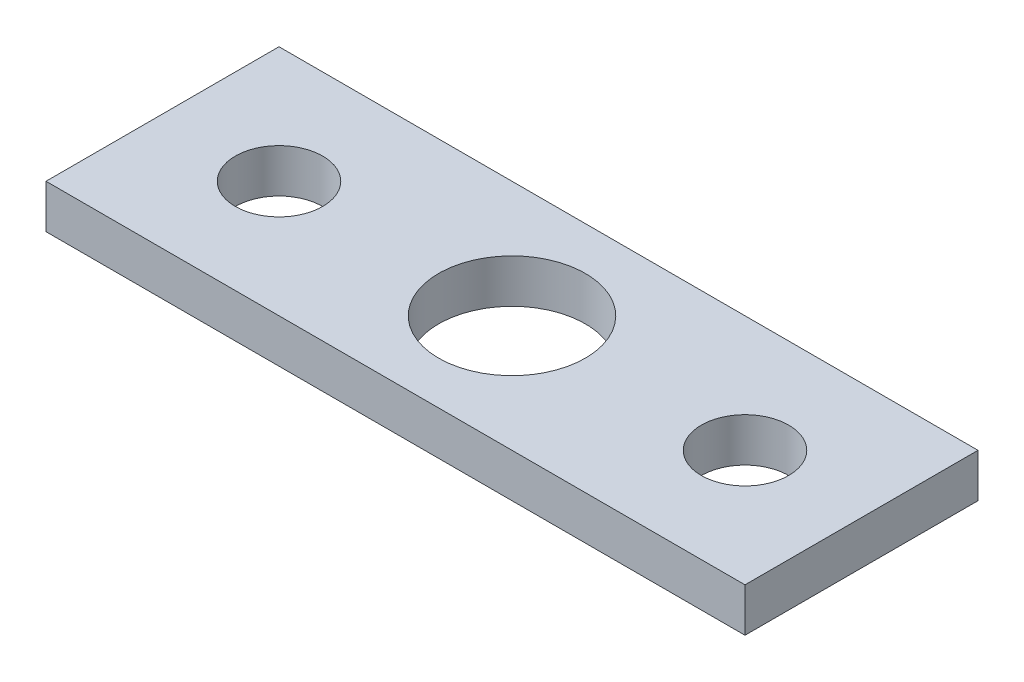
ISO-10303-21;
HEADER;
FILE_DESCRIPTION(('STEP AP214'),'2;1');
FILE_NAME('part.step','',(''),(''),'','','');
FILE_SCHEMA(('AUTOMOTIVE_DESIGN { 1 0 10303 214 1 1 1 1 }'));
ENDSEC;
DATA;
#1=APPLICATION_CONTEXT('core data for automotive mechanical design processes');
#2=APPLICATION_PROTOCOL_DEFINITION('international standard','automotive_design',2000,#1);
#3=PRODUCT_CONTEXT('',#1,'mechanical');
#4=PRODUCT('Part','Part','',(#3));
#5=PRODUCT_RELATED_PRODUCT_CATEGORY('part','',(#4));
#6=PRODUCT_DEFINITION_FORMATION('','',#4);
#7=PRODUCT_DEFINITION_CONTEXT('part definition',#1,'design');
#8=PRODUCT_DEFINITION('design','',#6,#7);
#9=PRODUCT_DEFINITION_SHAPE('','',#8);
#10=(LENGTH_UNIT() NAMED_UNIT(*) SI_UNIT(.MILLI.,.METRE.));
#11=(NAMED_UNIT(*) PLANE_ANGLE_UNIT() SI_UNIT($,.RADIAN.));
#12=(NAMED_UNIT(*) SI_UNIT($,.STERADIAN.) SOLID_ANGLE_UNIT());
#13=UNCERTAINTY_MEASURE_WITH_UNIT(LENGTH_MEASURE(1.E-05),#10,'distance_accuracy_value','');
#14=(GEOMETRIC_REPRESENTATION_CONTEXT(3) GLOBAL_UNCERTAINTY_ASSIGNED_CONTEXT((#13)) GLOBAL_UNIT_ASSIGNED_CONTEXT((#10,
#11,#12)) REPRESENTATION_CONTEXT('',''));
#15=CARTESIAN_POINT('',(0.,0.,0.));
#16=DIRECTION('',(0.,0.,1.));
#17=DIRECTION('',(1.,0.,0.));
#18=AXIS2_PLACEMENT_3D('',#15,#16,#17);
#19=CARTESIAN_POINT('',(-76.2,9.525,-25.4));
#20=DIRECTION('',(1.,0.,0.));
#21=DIRECTION('',(0.,0.,-1.));
#22=AXIS2_PLACEMENT_3D('',#19,#20,#21);
#23=PLANE('',#22);
#24=DIRECTION('',(0.,0.,1.));
#25=VECTOR('',#24,1.);
#26=CARTESIAN_POINT('',(-76.2,0.,-25.4));
#27=LINE('',#26,#25);
#28=CARTESIAN_POINT('',(-76.2,0.,-25.4));
#29=VERTEX_POINT('',#28);
#30=CARTESIAN_POINT('',(-76.2,0.,25.4));
#31=VERTEX_POINT('',#30);
#32=EDGE_CURVE('E74',#29,#31,#27,.T.);
#33=ORIENTED_EDGE('',*,*,#32,.T.);
#34=DIRECTION('',(0.,-1.,0.));
#35=VECTOR('',#34,1.);
#36=CARTESIAN_POINT('',(-76.2,9.525,25.4));
#37=LINE('',#36,#35);
#38=CARTESIAN_POINT('',(-76.2,9.525,25.4));
#39=VERTEX_POINT('',#38);
#40=EDGE_CURVE('E11',#39,#31,#37,.T.);
#41=ORIENTED_EDGE('',*,*,#40,.F.);
#42=DIRECTION('',(0.,0.,1.));
#43=VECTOR('',#42,1.);
#44=CARTESIAN_POINT('',(-76.2,9.525,-25.4));
#45=LINE('',#44,#43);
#46=CARTESIAN_POINT('',(-76.2,9.525,-25.4));
#47=VERTEX_POINT('',#46);
#48=EDGE_CURVE('E97',#47,#39,#45,.T.);
#49=ORIENTED_EDGE('',*,*,#48,.F.);
#50=DIRECTION('',(0.,-1.,0.));
#51=VECTOR('',#50,1.);
#52=CARTESIAN_POINT('',(-76.2,9.525,-25.4));
#53=LINE('',#52,#51);
#54=EDGE_CURVE('E86',#47,#29,#53,.T.);
#55=ORIENTED_EDGE('',*,*,#54,.T.);
#56=EDGE_LOOP('',(#33,#41,#49,#55));
#57=FACE_BOUND('',#56,.T.);
#58=ADVANCED_FACE('F30',(#57),#23,.F.);
#59=CARTESIAN_POINT('',(-76.2,9.525,25.4));
#60=DIRECTION('',(0.,0.,-1.));
#61=DIRECTION('',(-1.,0.,0.));
#62=AXIS2_PLACEMENT_3D('',#59,#60,#61);
#63=PLANE('',#62);
#64=DIRECTION('',(1.,0.,0.));
#65=VECTOR('',#64,1.);
#66=CARTESIAN_POINT('',(-76.2,0.,25.4));
#67=LINE('',#66,#65);
#68=CARTESIAN_POINT('',(76.2,0.,25.4));
#69=VERTEX_POINT('',#68);
#70=EDGE_CURVE('E70',#31,#69,#67,.T.);
#71=ORIENTED_EDGE('',*,*,#70,.T.);
#72=DIRECTION('',(0.,-1.,0.));
#73=VECTOR('',#72,1.);
#74=CARTESIAN_POINT('',(76.2,9.525,25.4));
#75=LINE('',#74,#73);
#76=CARTESIAN_POINT('',(76.2,9.525,25.4));
#77=VERTEX_POINT('',#76);
#78=EDGE_CURVE('E37',#77,#69,#75,.T.);
#79=ORIENTED_EDGE('',*,*,#78,.F.);
#80=DIRECTION('',(1.,0.,0.));
#81=VECTOR('',#80,1.);
#82=CARTESIAN_POINT('',(-76.2,9.525,25.4));
#83=LINE('',#82,#81);
#84=EDGE_CURVE('E82',#39,#77,#83,.T.);
#85=ORIENTED_EDGE('',*,*,#84,.F.);
#86=ORIENTED_EDGE('',*,*,#40,.T.);
#87=EDGE_LOOP('',(#71,#79,#85,#86));
#88=FACE_BOUND('',#87,.T.);
#89=ADVANCED_FACE('F81',(#88),#63,.F.);
#90=CARTESIAN_POINT('',(76.2,9.525,-25.4));
#91=DIRECTION('',(-1.,0.,0.));
#92=DIRECTION('',(0.,0.,1.));
#93=AXIS2_PLACEMENT_3D('',#90,#91,#92);
#94=PLANE('',#93);
#95=DIRECTION('',(0.,0.,-1.));
#96=VECTOR('',#95,1.);
#97=CARTESIAN_POINT('',(76.2,0.,-25.4));
#98=LINE('',#97,#96);
#99=CARTESIAN_POINT('',(76.2,0.,-25.4));
#100=VERTEX_POINT('',#99);
#101=EDGE_CURVE('E75',#69,#100,#98,.T.);
#102=ORIENTED_EDGE('',*,*,#101,.T.);
#103=DIRECTION('',(0.,-1.,0.));
#104=VECTOR('',#103,1.);
#105=CARTESIAN_POINT('',(76.2,9.525,-25.4));
#106=LINE('',#105,#104);
#107=CARTESIAN_POINT('',(76.2,9.525,-25.4));
#108=VERTEX_POINT('',#107);
#109=EDGE_CURVE('E103',#108,#100,#106,.T.);
#110=ORIENTED_EDGE('',*,*,#109,.F.);
#111=DIRECTION('',(0.,0.,-1.));
#112=VECTOR('',#111,1.);
#113=CARTESIAN_POINT('',(76.2,9.525,-25.4));
#114=LINE('',#113,#112);
#115=EDGE_CURVE('E49',#77,#108,#114,.T.);
#116=ORIENTED_EDGE('',*,*,#115,.F.);
#117=ORIENTED_EDGE('',*,*,#78,.T.);
#118=EDGE_LOOP('',(#102,#110,#116,#117));
#119=FACE_BOUND('',#118,.T.);
#120=ADVANCED_FACE('F106',(#119),#94,.F.);
#121=CARTESIAN_POINT('',(-76.2,9.525,-25.4));
#122=DIRECTION('',(0.,0.,1.));
#123=DIRECTION('',(1.,0.,0.));
#124=AXIS2_PLACEMENT_3D('',#121,#122,#123);
#125=PLANE('',#124);
#126=DIRECTION('',(-1.,0.,0.));
#127=VECTOR('',#126,1.);
#128=CARTESIAN_POINT('',(-76.2,0.,-25.4));
#129=LINE('',#128,#127);
#130=EDGE_CURVE('E95',#100,#29,#129,.T.);
#131=ORIENTED_EDGE('',*,*,#130,.T.);
#132=ORIENTED_EDGE('',*,*,#54,.F.);
#133=DIRECTION('',(-1.,0.,0.));
#134=VECTOR('',#133,1.);
#135=CARTESIAN_POINT('',(-76.2,9.525,-25.4));
#136=LINE('',#135,#134);
#137=EDGE_CURVE('E44',#108,#47,#136,.T.);
#138=ORIENTED_EDGE('',*,*,#137,.F.);
#139=ORIENTED_EDGE('',*,*,#109,.T.);
#140=EDGE_LOOP('',(#131,#132,#138,#139));
#141=FACE_BOUND('',#140,.T.);
#142=ADVANCED_FACE('F108',(#141),#125,.F.);
#143=CARTESIAN_POINT('',(-76.2,9.525,25.4));
#144=DIRECTION('',(0.,1.,0.));
#145=DIRECTION('',(0.,0.,1.));
#146=AXIS2_PLACEMENT_3D('',#143,#144,#145);
#147=PLANE('',#146);
#148=CARTESIAN_POINT('',(-50.8,9.525,0.));
#149=DIRECTION('',(0.,1.,0.));
#150=DIRECTION('',(0.,0.,1.));
#151=AXIS2_PLACEMENT_3D('',#148,#149,#150);
#152=CIRCLE('',#151,9.52500000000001);
#153=CARTESIAN_POINT('',(-50.8,9.525,9.52500000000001));
#154=VERTEX_POINT('',#153);
#155=EDGE_CURVE('E185',#154,#154,#152,.T.);
#156=ORIENTED_EDGE('',*,*,#155,.F.);
#157=EDGE_LOOP('',(#156));
#158=FACE_BOUND('',#157,.T.);
#159=CARTESIAN_POINT('',(50.8,9.525,0.));
#160=DIRECTION('',(0.,1.,0.));
#161=DIRECTION('',(0.,0.,1.));
#162=AXIS2_PLACEMENT_3D('',#159,#160,#161);
#163=CIRCLE('',#162,9.525);
#164=CARTESIAN_POINT('',(50.8,9.525,9.525));
#165=VERTEX_POINT('',#164);
#166=EDGE_CURVE('E187',#165,#165,#163,.T.);
#167=ORIENTED_EDGE('',*,*,#166,.F.);
#168=EDGE_LOOP('',(#167));
#169=FACE_BOUND('',#168,.T.);
#170=CARTESIAN_POINT('',(0.,9.525,0.));
#171=DIRECTION('',(0.,1.,0.));
#172=DIRECTION('',(0.,0.,1.));
#173=AXIS2_PLACEMENT_3D('',#170,#171,#172);
#174=CIRCLE('',#173,16.002);
#175=CARTESIAN_POINT('',(0.,9.525,16.002));
#176=VERTEX_POINT('',#175);
#177=EDGE_CURVE('E90',#176,#176,#174,.T.);
#178=ORIENTED_EDGE('',*,*,#177,.F.);
#179=EDGE_LOOP('',(#178));
#180=FACE_BOUND('',#179,.T.);
#181=ORIENTED_EDGE('',*,*,#48,.T.);
#182=ORIENTED_EDGE('',*,*,#84,.T.);
#183=ORIENTED_EDGE('',*,*,#115,.T.);
#184=ORIENTED_EDGE('',*,*,#137,.T.);
#185=EDGE_LOOP('',(#181,#182,#183,#184));
#186=FACE_BOUND('',#185,.T.);
#187=ADVANCED_FACE('F109',(#158,#169,#180,#186),#147,.T.);
#188=CARTESIAN_POINT('',(-76.2,0.,25.4));
#189=DIRECTION('',(0.,1.,0.));
#190=DIRECTION('',(0.,0.,1.));
#191=AXIS2_PLACEMENT_3D('',#188,#189,#190);
#192=PLANE('',#191);
#193=CARTESIAN_POINT('',(-50.8,0.,0.));
#194=DIRECTION('',(0.,1.,0.));
#195=DIRECTION('',(0.,0.,1.));
#196=AXIS2_PLACEMENT_3D('',#193,#194,#195);
#197=CIRCLE('',#196,9.52500000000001);
#198=CARTESIAN_POINT('',(-50.8,0.,9.52500000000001));
#199=VERTEX_POINT('',#198);
#200=EDGE_CURVE('E183',#199,#199,#197,.T.);
#201=ORIENTED_EDGE('',*,*,#200,.T.);
#202=EDGE_LOOP('',(#201));
#203=FACE_BOUND('',#202,.T.);
#204=CARTESIAN_POINT('',(50.8,0.,0.));
#205=DIRECTION('',(0.,1.,0.));
#206=DIRECTION('',(0.,0.,1.));
#207=AXIS2_PLACEMENT_3D('',#204,#205,#206);
#208=CIRCLE('',#207,9.525);
#209=CARTESIAN_POINT('',(50.8,0.,9.525));
#210=VERTEX_POINT('',#209);
#211=EDGE_CURVE('E192',#210,#210,#208,.T.);
#212=ORIENTED_EDGE('',*,*,#211,.T.);
#213=EDGE_LOOP('',(#212));
#214=FACE_BOUND('',#213,.T.);
#215=CARTESIAN_POINT('',(0.,0.,0.));
#216=DIRECTION('',(0.,1.,0.));
#217=DIRECTION('',(0.,0.,1.));
#218=AXIS2_PLACEMENT_3D('',#215,#216,#217);
#219=CIRCLE('',#218,16.002);
#220=CARTESIAN_POINT('',(0.,0.,16.002));
#221=VERTEX_POINT('',#220);
#222=EDGE_CURVE('E87',#221,#221,#219,.T.);
#223=ORIENTED_EDGE('',*,*,#222,.T.);
#224=EDGE_LOOP('',(#223));
#225=FACE_BOUND('',#224,.T.);
#226=ORIENTED_EDGE('',*,*,#32,.F.);
#227=ORIENTED_EDGE('',*,*,#130,.F.);
#228=ORIENTED_EDGE('',*,*,#101,.F.);
#229=ORIENTED_EDGE('',*,*,#70,.F.);
#230=EDGE_LOOP('',(#226,#227,#228,#229));
#231=FACE_BOUND('',#230,.T.);
#232=ADVANCED_FACE('F71',(#203,#214,#225,#231),#192,.F.);
#233=CARTESIAN_POINT('',(0.,0.,0.));
#234=DIRECTION('',(0.,1.,0.));
#235=DIRECTION('',(0.,0.,1.));
#236=AXIS2_PLACEMENT_3D('',#233,#234,#235);
#237=CYLINDRICAL_SURFACE('',#236,16.002);
#238=CARTESIAN_POINT('',(0.,0.,16.002));
#239=CARTESIAN_POINT('',(0.,0.0992187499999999,16.002));
#240=CARTESIAN_POINT('',(0.,0.1984375,16.002));
#241=CARTESIAN_POINT('',(0.,0.396875,16.002));
#242=CARTESIAN_POINT('',(0.,0.49609375,16.002));
#243=CARTESIAN_POINT('',(0.,0.69453125,16.002));
#244=CARTESIAN_POINT('',(0.,0.79375,16.002));
#245=CARTESIAN_POINT('',(0.,0.9921875,16.002));
#246=CARTESIAN_POINT('',(0.,1.09140625,16.002));
#247=CARTESIAN_POINT('',(0.,1.28984375,16.002));
#248=CARTESIAN_POINT('',(0.,1.3890625,16.002));
#249=CARTESIAN_POINT('',(0.,1.5875,16.002));
#250=CARTESIAN_POINT('',(0.,1.68671875,16.002));
#251=CARTESIAN_POINT('',(0.,1.88515625,16.002));
#252=CARTESIAN_POINT('',(0.,1.984375,16.002));
#253=CARTESIAN_POINT('',(0.,2.1828125,16.002));
#254=CARTESIAN_POINT('',(0.,2.28203125,16.002));
#255=CARTESIAN_POINT('',(0.,2.48046875,16.002));
#256=CARTESIAN_POINT('',(0.,2.5796875,16.002));
#257=CARTESIAN_POINT('',(0.,2.778125,16.002));
#258=CARTESIAN_POINT('',(0.,2.87734375,16.002));
#259=CARTESIAN_POINT('',(0.,3.07578125,16.002));
#260=CARTESIAN_POINT('',(0.,3.175,16.002));
#261=CARTESIAN_POINT('',(0.,3.3734375,16.002));
#262=CARTESIAN_POINT('',(0.,3.47265625,16.002));
#263=CARTESIAN_POINT('',(0.,3.67109375,16.002));
#264=CARTESIAN_POINT('',(0.,3.7703125,16.002));
#265=CARTESIAN_POINT('',(0.,3.96875,16.002));
#266=CARTESIAN_POINT('',(0.,4.06796875,16.002));
#267=CARTESIAN_POINT('',(0.,4.26640625,16.002));
#268=CARTESIAN_POINT('',(0.,4.365625,16.002));
#269=CARTESIAN_POINT('',(0.,4.5640625,16.002));
#270=CARTESIAN_POINT('',(0.,4.66328125,16.002));
#271=CARTESIAN_POINT('',(0.,4.86171875,16.002));
#272=CARTESIAN_POINT('',(0.,4.9609375,16.002));
#273=CARTESIAN_POINT('',(0.,5.159375,16.002));
#274=CARTESIAN_POINT('',(0.,5.25859375,16.002));
#275=CARTESIAN_POINT('',(0.,5.45703125,16.002));
#276=CARTESIAN_POINT('',(0.,5.55625,16.002));
#277=CARTESIAN_POINT('',(0.,5.7546875,16.002));
#278=CARTESIAN_POINT('',(0.,5.85390625,16.002));
#279=CARTESIAN_POINT('',(0.,6.05234375,16.002));
#280=CARTESIAN_POINT('',(0.,6.1515625,16.002));
#281=CARTESIAN_POINT('',(0.,6.35,16.002));
#282=CARTESIAN_POINT('',(0.,6.44921875,16.002));
#283=CARTESIAN_POINT('',(0.,6.64765625,16.002));
#284=CARTESIAN_POINT('',(0.,6.746875,16.002));
#285=CARTESIAN_POINT('',(0.,6.9453125,16.002));
#286=CARTESIAN_POINT('',(0.,7.04453125,16.002));
#287=CARTESIAN_POINT('',(0.,7.24296875,16.002));
#288=CARTESIAN_POINT('',(0.,7.3421875,16.002));
#289=CARTESIAN_POINT('',(0.,7.540625,16.002));
#290=CARTESIAN_POINT('',(0.,7.63984375,16.002));
#291=CARTESIAN_POINT('',(0.,7.83828125,16.002));
#292=CARTESIAN_POINT('',(0.,7.9375,16.002));
#293=CARTESIAN_POINT('',(0.,8.1359375,16.002));
#294=CARTESIAN_POINT('',(0.,8.23515625,16.002));
#295=CARTESIAN_POINT('',(0.,8.43359375,16.002));
#296=CARTESIAN_POINT('',(0.,8.5328125,16.002));
#297=CARTESIAN_POINT('',(0.,8.73125,16.002));
#298=CARTESIAN_POINT('',(0.,8.83046875,16.002));
#299=CARTESIAN_POINT('',(0.,9.02890625,16.002));
#300=CARTESIAN_POINT('',(0.,9.128125,16.002));
#301=CARTESIAN_POINT('',(0.,9.3265625,16.002));
#302=CARTESIAN_POINT('',(0.,9.42578125,16.002));
#303=CARTESIAN_POINT('',(0.,9.525,16.002));
#304=B_SPLINE_CURVE_WITH_KNOTS('',3,(#238,#239,#240,#241,#242,#243,#244,#245,#246,#247,#248,
#249,#250,#251,#252,#253,#254,#255,#256,#257,#258,#259,#260,#261,#262,#263,#264,#265,#266,#267,
#268,#269,#270,#271,#272,#273,#274,#275,#276,#277,#278,#279,#280,#281,#282,#283,#284,#285,#286,
#287,#288,#289,#290,#291,#292,#293,#294,#295,#296,#297,#298,#299,#300,#301,#302,#303),
.UNSPECIFIED.,.F.,.F.,(4,2,2,2,2,2,2,2,2,2,2,2,2,2,2,2,2,2,2,2,2,2,2,2,2,2,2,2,2,2,2,2,4),(0.,
0.29765625,0.5953125,0.89296875,1.190625,1.48828125,1.7859375,2.08359375,2.38125,2.67890625,
2.9765625,3.27421875,3.571875,3.86953125,4.1671875,4.46484375,4.7625,5.06015625,5.3578125,
5.65546875,5.953125,6.25078125,6.5484375,6.84609375,7.14375,7.44140625,7.7390625,8.03671875,
8.334375,8.63203125,8.9296875,9.22734375,9.525),.UNSPECIFIED.);
#305=EDGE_CURVE('BSEAM117',#221,#176,#304,.T.);
#306=ORIENTED_EDGE('',*,*,#222,.F.);
#307=ORIENTED_EDGE('',*,*,#177,.T.);
#308=ORIENTED_EDGE('',*,*,#305,.T.);
#309=ORIENTED_EDGE('',*,*,#305,.F.);
#310=EDGE_LOOP('',(#306,#308,#307,#309));
#311=FACE_BOUND('',#310,.T.);
#312=ADVANCED_FACE('F117',(#311),#237,.F.);
#313=CARTESIAN_POINT('',(50.8,0.,0.));
#314=DIRECTION('',(0.,1.,0.));
#315=DIRECTION('',(0.,0.,1.));
#316=AXIS2_PLACEMENT_3D('',#313,#314,#315);
#317=CYLINDRICAL_SURFACE('',#316,9.525);
#318=CARTESIAN_POINT('',(50.8,0.,9.525));
#319=CARTESIAN_POINT('',(50.8,0.0992187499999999,9.525));
#320=CARTESIAN_POINT('',(50.8,0.1984375,9.525));
#321=CARTESIAN_POINT('',(50.8,0.396875,9.525));
#322=CARTESIAN_POINT('',(50.8,0.49609375,9.525));
#323=CARTESIAN_POINT('',(50.8,0.69453125,9.525));
#324=CARTESIAN_POINT('',(50.8,0.79375,9.525));
#325=CARTESIAN_POINT('',(50.8,0.9921875,9.525));
#326=CARTESIAN_POINT('',(50.8,1.09140625,9.525));
#327=CARTESIAN_POINT('',(50.8,1.28984375,9.525));
#328=CARTESIAN_POINT('',(50.8,1.3890625,9.525));
#329=CARTESIAN_POINT('',(50.8,1.5875,9.525));
#330=CARTESIAN_POINT('',(50.8,1.68671875,9.525));
#331=CARTESIAN_POINT('',(50.8,1.88515625,9.525));
#332=CARTESIAN_POINT('',(50.8,1.984375,9.525));
#333=CARTESIAN_POINT('',(50.8,2.1828125,9.525));
#334=CARTESIAN_POINT('',(50.8,2.28203125,9.525));
#335=CARTESIAN_POINT('',(50.8,2.48046875,9.525));
#336=CARTESIAN_POINT('',(50.8,2.5796875,9.525));
#337=CARTESIAN_POINT('',(50.8,2.778125,9.525));
#338=CARTESIAN_POINT('',(50.8,2.87734375,9.525));
#339=CARTESIAN_POINT('',(50.8,3.07578125,9.525));
#340=CARTESIAN_POINT('',(50.8,3.175,9.525));
#341=CARTESIAN_POINT('',(50.8,3.3734375,9.525));
#342=CARTESIAN_POINT('',(50.8,3.47265625,9.525));
#343=CARTESIAN_POINT('',(50.8,3.67109375,9.525));
#344=CARTESIAN_POINT('',(50.8,3.7703125,9.525));
#345=CARTESIAN_POINT('',(50.8,3.96875,9.525));
#346=CARTESIAN_POINT('',(50.8,4.06796875,9.525));
#347=CARTESIAN_POINT('',(50.8,4.26640625,9.525));
#348=CARTESIAN_POINT('',(50.8,4.365625,9.525));
#349=CARTESIAN_POINT('',(50.8,4.5640625,9.525));
#350=CARTESIAN_POINT('',(50.8,4.66328125,9.525));
#351=CARTESIAN_POINT('',(50.8,4.86171875,9.525));
#352=CARTESIAN_POINT('',(50.8,4.9609375,9.525));
#353=CARTESIAN_POINT('',(50.8,5.159375,9.525));
#354=CARTESIAN_POINT('',(50.8,5.25859375,9.525));
#355=CARTESIAN_POINT('',(50.8,5.45703125,9.525));
#356=CARTESIAN_POINT('',(50.8,5.55625,9.525));
#357=CARTESIAN_POINT('',(50.8,5.7546875,9.525));
#358=CARTESIAN_POINT('',(50.8,5.85390625,9.525));
#359=CARTESIAN_POINT('',(50.8,6.05234375,9.525));
#360=CARTESIAN_POINT('',(50.8,6.1515625,9.525));
#361=CARTESIAN_POINT('',(50.8,6.35,9.525));
#362=CARTESIAN_POINT('',(50.8,6.44921875,9.525));
#363=CARTESIAN_POINT('',(50.8,6.64765625,9.525));
#364=CARTESIAN_POINT('',(50.8,6.746875,9.525));
#365=CARTESIAN_POINT('',(50.8,6.9453125,9.525));
#366=CARTESIAN_POINT('',(50.8,7.04453125,9.525));
#367=CARTESIAN_POINT('',(50.8,7.24296875,9.525));
#368=CARTESIAN_POINT('',(50.8,7.3421875,9.525));
#369=CARTESIAN_POINT('',(50.8,7.540625,9.525));
#370=CARTESIAN_POINT('',(50.8,7.63984375,9.525));
#371=CARTESIAN_POINT('',(50.8,7.83828125,9.525));
#372=CARTESIAN_POINT('',(50.8,7.9375,9.525));
#373=CARTESIAN_POINT('',(50.8,8.1359375,9.525));
#374=CARTESIAN_POINT('',(50.8,8.23515625,9.525));
#375=CARTESIAN_POINT('',(50.8,8.43359375,9.525));
#376=CARTESIAN_POINT('',(50.8,8.5328125,9.525));
#377=CARTESIAN_POINT('',(50.8,8.73125,9.525));
#378=CARTESIAN_POINT('',(50.8,8.83046875,9.525));
#379=CARTESIAN_POINT('',(50.8,9.02890625,9.525));
#380=CARTESIAN_POINT('',(50.8,9.128125,9.525));
#381=CARTESIAN_POINT('',(50.8,9.3265625,9.525));
#382=CARTESIAN_POINT('',(50.8,9.42578125,9.525));
#383=CARTESIAN_POINT('',(50.8,9.525,9.525));
#384=B_SPLINE_CURVE_WITH_KNOTS('',3,(#318,#319,#320,#321,#322,#323,#324,#325,#326,#327,#328,
#329,#330,#331,#332,#333,#334,#335,#336,#337,#338,#339,#340,#341,#342,#343,#344,#345,#346,#347,
#348,#349,#350,#351,#352,#353,#354,#355,#356,#357,#358,#359,#360,#361,#362,#363,#364,#365,#366,
#367,#368,#369,#370,#371,#372,#373,#374,#375,#376,#377,#378,#379,#380,#381,#382,#383),
.UNSPECIFIED.,.F.,.F.,(4,2,2,2,2,2,2,2,2,2,2,2,2,2,2,2,2,2,2,2,2,2,2,2,2,2,2,2,2,2,2,2,4),(0.,
0.29765625,0.5953125,0.89296875,1.190625,1.48828125,1.7859375,2.08359375,2.38125,2.67890625,
2.9765625,3.27421875,3.571875,3.86953125,4.1671875,4.46484375,4.7625,5.06015625,5.3578125,
5.65546875,5.953125,6.25078125,6.5484375,6.84609375,7.14375,7.44140625,7.7390625,8.03671875,
8.334375,8.63203125,8.9296875,9.22734375,9.525),.UNSPECIFIED.);
#385=EDGE_CURVE('BSEAM146',#210,#165,#384,.T.);
#386=ORIENTED_EDGE('',*,*,#211,.F.);
#387=ORIENTED_EDGE('',*,*,#166,.T.);
#388=ORIENTED_EDGE('',*,*,#385,.T.);
#389=ORIENTED_EDGE('',*,*,#385,.F.);
#390=EDGE_LOOP('',(#386,#388,#387,#389));
#391=FACE_BOUND('',#390,.T.);
#392=ADVANCED_FACE('F146',(#391),#317,.F.);
#393=CARTESIAN_POINT('',(-50.8,0.,0.));
#394=DIRECTION('',(0.,1.,0.));
#395=DIRECTION('',(0.,0.,1.));
#396=AXIS2_PLACEMENT_3D('',#393,#394,#395);
#397=CYLINDRICAL_SURFACE('',#396,9.52500000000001);
#398=CARTESIAN_POINT('',(-50.8,0.,9.52500000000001));
#399=CARTESIAN_POINT('',(-50.8,0.0992187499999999,9.52500000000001));
#400=CARTESIAN_POINT('',(-50.8,0.1984375,9.52500000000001));
#401=CARTESIAN_POINT('',(-50.8,0.396875,9.52500000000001));
#402=CARTESIAN_POINT('',(-50.8,0.49609375,9.52500000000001));
#403=CARTESIAN_POINT('',(-50.8,0.69453125,9.52500000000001));
#404=CARTESIAN_POINT('',(-50.8,0.79375,9.52500000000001));
#405=CARTESIAN_POINT('',(-50.8,0.9921875,9.52500000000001));
#406=CARTESIAN_POINT('',(-50.8,1.09140625,9.52500000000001));
#407=CARTESIAN_POINT('',(-50.8,1.28984375,9.52500000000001));
#408=CARTESIAN_POINT('',(-50.8,1.3890625,9.52500000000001));
#409=CARTESIAN_POINT('',(-50.8,1.5875,9.52500000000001));
#410=CARTESIAN_POINT('',(-50.8,1.68671875,9.52500000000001));
#411=CARTESIAN_POINT('',(-50.8,1.88515625,9.52500000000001));
#412=CARTESIAN_POINT('',(-50.8,1.984375,9.52500000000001));
#413=CARTESIAN_POINT('',(-50.8,2.1828125,9.52500000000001));
#414=CARTESIAN_POINT('',(-50.8,2.28203125,9.52500000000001));
#415=CARTESIAN_POINT('',(-50.8,2.48046875,9.52500000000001));
#416=CARTESIAN_POINT('',(-50.8,2.5796875,9.52500000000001));
#417=CARTESIAN_POINT('',(-50.8,2.778125,9.52500000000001));
#418=CARTESIAN_POINT('',(-50.8,2.87734375,9.52500000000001));
#419=CARTESIAN_POINT('',(-50.8,3.07578125,9.52500000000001));
#420=CARTESIAN_POINT('',(-50.8,3.175,9.52500000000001));
#421=CARTESIAN_POINT('',(-50.8,3.3734375,9.52500000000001));
#422=CARTESIAN_POINT('',(-50.8,3.47265625,9.52500000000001));
#423=CARTESIAN_POINT('',(-50.8,3.67109375,9.52500000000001));
#424=CARTESIAN_POINT('',(-50.8,3.7703125,9.52500000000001));
#425=CARTESIAN_POINT('',(-50.8,3.96875,9.52500000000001));
#426=CARTESIAN_POINT('',(-50.8,4.06796875,9.52500000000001));
#427=CARTESIAN_POINT('',(-50.8,4.26640625,9.52500000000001));
#428=CARTESIAN_POINT('',(-50.8,4.365625,9.52500000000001));
#429=CARTESIAN_POINT('',(-50.8,4.5640625,9.52500000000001));
#430=CARTESIAN_POINT('',(-50.8,4.66328125,9.52500000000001));
#431=CARTESIAN_POINT('',(-50.8,4.86171875,9.52500000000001));
#432=CARTESIAN_POINT('',(-50.8,4.9609375,9.52500000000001));
#433=CARTESIAN_POINT('',(-50.8,5.159375,9.52500000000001));
#434=CARTESIAN_POINT('',(-50.8,5.25859375,9.52500000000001));
#435=CARTESIAN_POINT('',(-50.8,5.45703125,9.52500000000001));
#436=CARTESIAN_POINT('',(-50.8,5.55625,9.52500000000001));
#437=CARTESIAN_POINT('',(-50.8,5.7546875,9.52500000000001));
#438=CARTESIAN_POINT('',(-50.8,5.85390625,9.52500000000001));
#439=CARTESIAN_POINT('',(-50.8,6.05234375,9.52500000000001));
#440=CARTESIAN_POINT('',(-50.8,6.1515625,9.52500000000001));
#441=CARTESIAN_POINT('',(-50.8,6.35,9.52500000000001));
#442=CARTESIAN_POINT('',(-50.8,6.44921875,9.52500000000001));
#443=CARTESIAN_POINT('',(-50.8,6.64765625,9.52500000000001));
#444=CARTESIAN_POINT('',(-50.8,6.746875,9.52500000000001));
#445=CARTESIAN_POINT('',(-50.8,6.9453125,9.52500000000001));
#446=CARTESIAN_POINT('',(-50.8,7.04453125,9.52500000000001));
#447=CARTESIAN_POINT('',(-50.8,7.24296875,9.52500000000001));
#448=CARTESIAN_POINT('',(-50.8,7.3421875,9.52500000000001));
#449=CARTESIAN_POINT('',(-50.8,7.540625,9.52500000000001));
#450=CARTESIAN_POINT('',(-50.8,7.63984375,9.52500000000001));
#451=CARTESIAN_POINT('',(-50.8,7.83828125,9.52500000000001));
#452=CARTESIAN_POINT('',(-50.8,7.9375,9.52500000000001));
#453=CARTESIAN_POINT('',(-50.8,8.1359375,9.52500000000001));
#454=CARTESIAN_POINT('',(-50.8,8.23515625,9.52500000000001));
#455=CARTESIAN_POINT('',(-50.8,8.43359375,9.52500000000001));
#456=CARTESIAN_POINT('',(-50.8,8.5328125,9.52500000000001));
#457=CARTESIAN_POINT('',(-50.8,8.73125,9.52500000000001));
#458=CARTESIAN_POINT('',(-50.8,8.83046875,9.52500000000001));
#459=CARTESIAN_POINT('',(-50.8,9.02890625,9.52500000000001));
#460=CARTESIAN_POINT('',(-50.8,9.128125,9.52500000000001));
#461=CARTESIAN_POINT('',(-50.8,9.3265625,9.52500000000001));
#462=CARTESIAN_POINT('',(-50.8,9.42578125,9.52500000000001));
#463=CARTESIAN_POINT('',(-50.8,9.525,9.52500000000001));
#464=B_SPLINE_CURVE_WITH_KNOTS('',3,(#398,#399,#400,#401,#402,#403,#404,#405,#406,#407,#408,
#409,#410,#411,#412,#413,#414,#415,#416,#417,#418,#419,#420,#421,#422,#423,#424,#425,#426,#427,
#428,#429,#430,#431,#432,#433,#434,#435,#436,#437,#438,#439,#440,#441,#442,#443,#444,#445,#446,
#447,#448,#449,#450,#451,#452,#453,#454,#455,#456,#457,#458,#459,#460,#461,#462,#463),
.UNSPECIFIED.,.F.,.F.,(4,2,2,2,2,2,2,2,2,2,2,2,2,2,2,2,2,2,2,2,2,2,2,2,2,2,2,2,2,2,2,2,4),(0.,
0.29765625,0.5953125,0.89296875,1.190625,1.48828125,1.7859375,2.08359375,2.38125,2.67890625,
2.9765625,3.27421875,3.571875,3.86953125,4.1671875,4.46484375,4.7625,5.06015625,5.3578125,
5.65546875,5.953125,6.25078125,6.5484375,6.84609375,7.14375,7.44140625,7.7390625,8.03671875,
8.334375,8.63203125,8.9296875,9.22734375,9.525),.UNSPECIFIED.);
#465=EDGE_CURVE('BSEAM166',#199,#154,#464,.T.);
#466=ORIENTED_EDGE('',*,*,#200,.F.);
#467=ORIENTED_EDGE('',*,*,#155,.T.);
#468=ORIENTED_EDGE('',*,*,#465,.T.);
#469=ORIENTED_EDGE('',*,*,#465,.F.);
#470=EDGE_LOOP('',(#466,#468,#467,#469));
#471=FACE_BOUND('',#470,.T.);
#472=ADVANCED_FACE('F166',(#471),#397,.F.);
#473=CLOSED_SHELL('',(#58,#89,#120,#142,#187,#232,#312,#392,#472));
#474=MANIFOLD_SOLID_BREP('B2',#473);
#475=ADVANCED_BREP_SHAPE_REPRESENTATION('',(#18,#474),#14);
#476=SHAPE_DEFINITION_REPRESENTATION(#9,#475);
ENDSEC;
END-ISO-10303-21;
